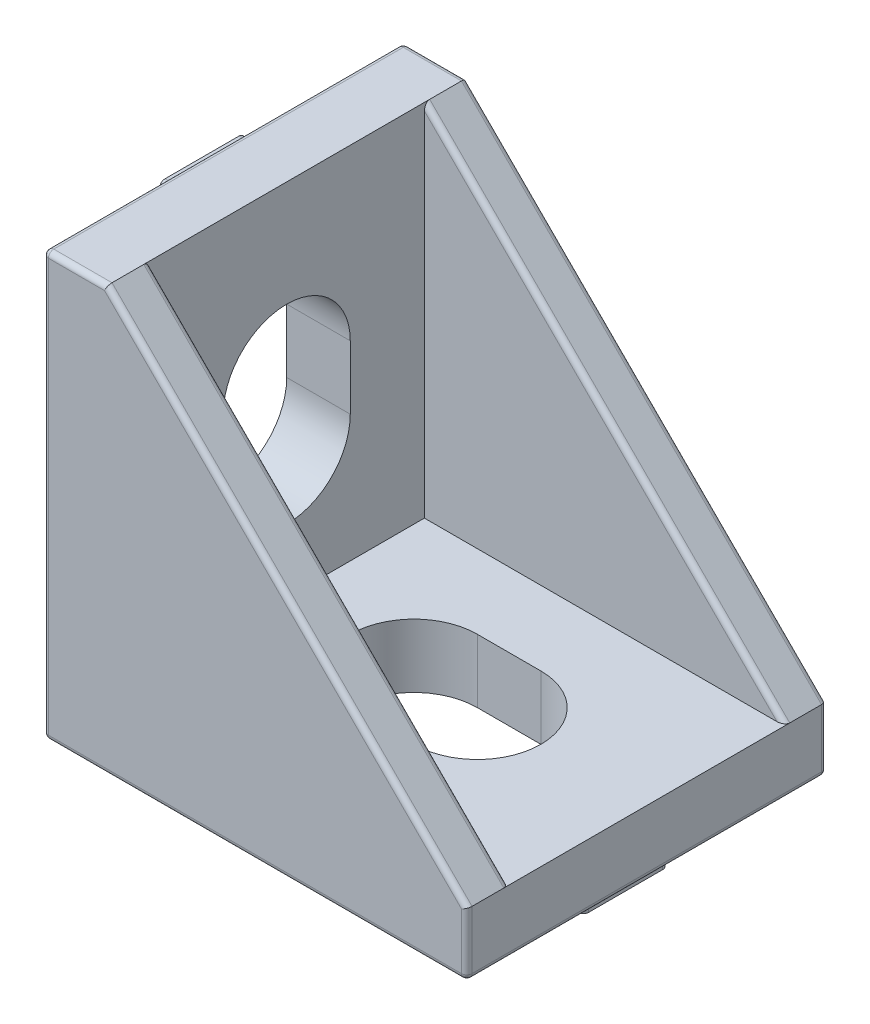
from build123d import *

# Parameters (mm, degrees)
BOSS_EXTRUDE1_DEPTH = 2
SKETCH2_W           = 3
SKETCH2_H           = 17
BOSS_EXTRUDE2_DEPTH = 13
BOSS_EXTRUDE3_DEPTH = 2
SKETCH4_W           = 20
SKETCH4_H           = 17
BOSS_EXTRUDE4_DEPTH = 3
CUT_EXTRUDE1_DEPTH  = 28.590759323
CUT_EXTRUDE2_DEPTH  = 30.533878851
SKETCH7_W           = 4
SKETCH7_H           = 2
BOSS_EXTRUDE5_DEPTH = 1
SKETCH8_W           = 4
SKETCH8_H           = 2
BOSS_EXTRUDE6_DEPTH = 1
SKETCH9_W           = 2
SKETCH9_H           = 4
BOSS_EXTRUDE7_DEPTH = 1
SKETCH10_W          = 2
SKETCH10_H          = 4
BOSS_EXTRUDE8_DEPTH = 1
FILLET2_R           = 0.25


with BuildPart() as part:
    # Sketch1 → Boss-Extrude1 (new body)
    with BuildSketch(Plane(origin=(0, 0, 6.5), x_dir=(-1, 0, 0), z_dir=(0, 0, -1))):
        Polygon((-20, 3), (0, 3), (0, 20), (-3, 20), align=None)
    extrude(amount=-BOSS_EXTRUDE1_DEPTH)

    # Sketch2 → Boss-Extrude2 (add)
    with BuildSketch(Plane(origin=(0, 0, 6.5), x_dir=(-1, 0, 0), z_dir=(0, 0, -1))):
        with Locations((-1.5, 11.5)):
            Rectangle(SKETCH2_W, SKETCH2_H)
    extrude(amount=BOSS_EXTRUDE2_DEPTH)

    # Sketch3 → Boss-Extrude3 (add)
    with BuildSketch(Plane(origin=(0, 0, -6.5), x_dir=(-1, 0, 0), z_dir=(0, 0, -1))):
        Polygon((-20, 3), (-3, 20), (0, 20), (0, 3), align=None)
    extrude(amount=BOSS_EXTRUDE3_DEPTH)

    # Sketch4 → Boss-Extrude4 (add)
    with BuildSketch(Plane.XZ.offset(-3)):
        with Locations((10, 0)):
            Rectangle(SKETCH4_W, SKETCH4_H)
    extrude(amount=BOSS_EXTRUDE4_DEPTH)

    # Sketch5 → Cut-Extrude1 (cut, through all)
    with BuildSketch(Plane(origin=(3, 0, 0), x_dir=(0, 0, -1), z_dir=(1, 0, 0))):
        with BuildLine():
            Line((3, 9), (3, 12))
            ThreePointArc((3, 12), (0, 15), (-3, 12))
            Line((-3, 12), (-3, 9))
            ThreePointArc((-3, 9), (0, 6), (3, 9))
        make_face()
    extrude(amount=-CUT_EXTRUDE1_DEPTH, mode=Mode.SUBTRACT)

    # Sketch6 → Cut-Extrude2 (cut, through all)
    with BuildSketch(Plane.XZ):
        with BuildLine():
            Line((9, -3), (12, -3))
            ThreePointArc((12, -3), (15, 0), (12, 3))
            Line((12, 3), (9, 3))
            ThreePointArc((9, 3), (6, 0), (9, -3))
        make_face()
    extrude(amount=-CUT_EXTRUDE2_DEPTH, mode=Mode.SUBTRACT)

    # Sketch7 → Boss-Extrude5 (add)
    with BuildSketch(Plane.ZY):
        with Locations((0, 18)):
            Rectangle(SKETCH7_W, SKETCH7_H)
    extrude(amount=BOSS_EXTRUDE5_DEPTH)

    # Sketch8 → Boss-Extrude6 (add)
    with BuildSketch(Plane.ZY):
        with Locations((0, 3)):
            Rectangle(SKETCH8_W, SKETCH8_H)
    extrude(amount=BOSS_EXTRUDE6_DEPTH)

    # Sketch9 → Boss-Extrude7 (add)
    with BuildSketch(Plane.XZ):
        with Locations((3, 0)):
            Rectangle(SKETCH9_W, SKETCH9_H)
    extrude(amount=BOSS_EXTRUDE7_DEPTH)

    # Sketch10 → Boss-Extrude8 (add)
    with BuildSketch(Plane.XZ):
        with Locations((18, 0)):
            Rectangle(SKETCH10_W, SKETCH10_H)
    extrude(amount=BOSS_EXTRUDE8_DEPTH)

    # Fillet2
    fillet2_edges = [part.edges().sort_by_distance(p)[0] for p in [
        (-0.5, 4, -2),
        (-0.5, 2, -2),
        (-0.5, 2, 2),
        (-0.5, 4, 2),
        (4, -0.5, 2),
        (2, -0.5, 2),
        (2, -0.5, -2),
        (4, -0.5, -2),
        (0, 10, 8.5),
        (19, -0.5, 2),
        (17, -0.5, 2),
        (17, -0.5, -2),
        (19, -0.5, -2),
        (1.5, 20, 8.5),
        (11.5, 11.5, -6.5),
        (0, 10, -8.5),
        (1.5, 20, -8.5),
        (11.5, 11.5, -8.5),
        (20, 1.5, 8.5),
        (20, 1.5, -8.5),
        (10, 0, 8.5),
        (0, 0, 0),
        (10, 0, -8.5),
        (20, 0, 0),
        (11.5, 11.5, 8.5),
        (11.5, 11.5, 6.5),
        (0, 20, 0),
        (-0.5, 19, -2),
        (-0.5, 17, -2),
        (-0.5, 17, 2),
        (-0.5, 19, 2),
    ]]
    fillet(fillet2_edges, radius=FILLET2_R)


solid = part.part
